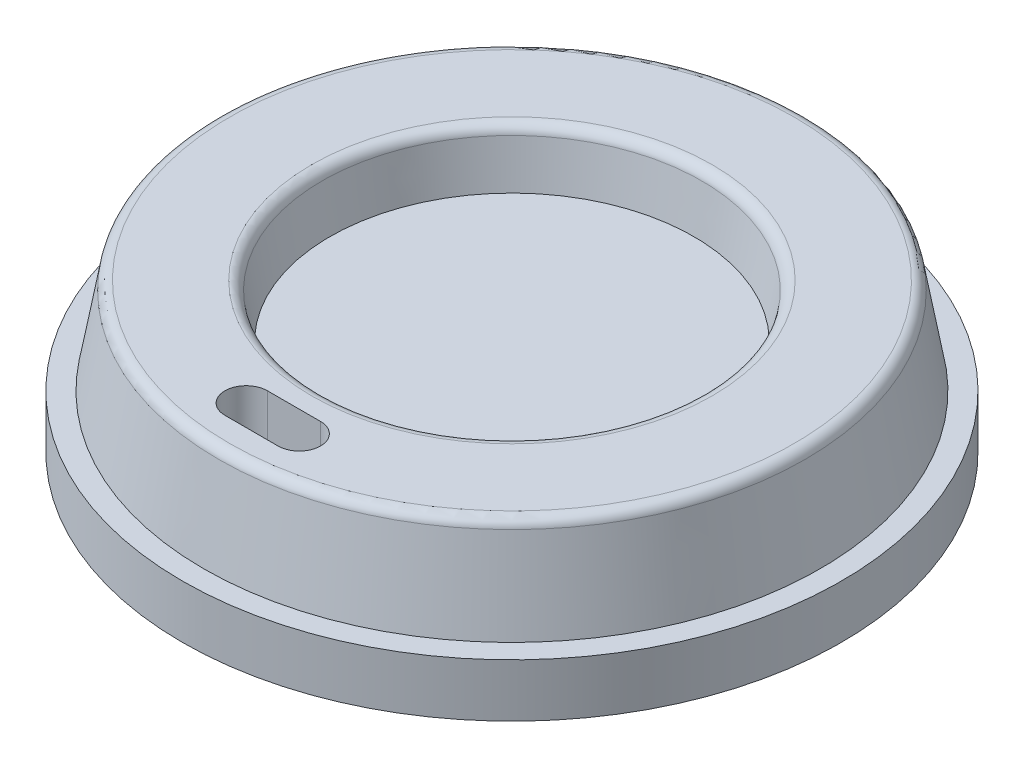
from build123d import *

# Parameters (mm, degrees)
SKETCH1_R           = 23
BOSS_EXTRUDE1_DEPTH = 5
SKETCH2_R           = 31
BOSS_EXTRUDE2_DEPTH = 5
SKETCH3_R           = 29
BOSS_EXTRUDE3_DEPTH = 9
BOSS_EXTRUDE3_TAPER = 10
FILLET1_R           = 1
SKETCH5_R           = 18
CUT_EXTRUDE1_DEPTH  = 5
CUT_EXTRUDE1_DRAFT  = -10
FILLET2_R           = 1
CUT_EXTRUDE2_DEPTH  = 48.780749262


with BuildPart() as part:
    # Sketch1 → Boss-Extrude1 (new body)
    with BuildSketch(Plane(origin=(0, 0, 0), x_dir=(1, 0, 0), z_dir=(0, 1, 0))):
        with Locations(Location((0, 0, 0), (0, 0, 270))):
            Circle(SKETCH1_R)
    extrude(amount=BOSS_EXTRUDE1_DEPTH)

    # Sketch2 → Boss-Extrude2 (add)
    with BuildSketch(Plane(origin=(0, 5, 0), x_dir=(1, 0, 0), z_dir=(0, 1, 0))):
        with Locations(Location((0, 0, 0), (0, 0, 270))):
            Circle(SKETCH2_R)
    extrude(amount=BOSS_EXTRUDE2_DEPTH)

    # Sketch3 → Boss-Extrude3 (add)
    with BuildSketch(Plane(origin=(0, 10, 0), x_dir=(1, 0, 0), z_dir=(0, 1, 0))):
        Circle(SKETCH3_R)
    extrude(amount=BOSS_EXTRUDE3_DEPTH, taper=BOSS_EXTRUDE3_TAPER)

    # Fillet1
    fillet1_edges = [part.edges().sort_by_distance(p)[0] for p in [
        (-27.413057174, 19, 0),
    ]]
    fillet(fillet1_edges, radius=FILLET1_R)


with BuildPart() as cut_extrude1_tool:
    # Sketch5 → Cut-Extrude1 (with draft: the straight prism first)
    with BuildSketch(Plane(origin=(0, 19, 0), x_dir=(1, 0, 0), z_dir=(0, 1, 0))):
        Circle(SKETCH5_R)
    extrude(amount=-CUT_EXTRUDE1_DEPTH)
    # Cut-Extrude1: the draft: its side faces are tilted about the plane it starts from
    cut_extrude1_sides = [cut_extrude1_tool.faces().sort_by_distance(p)[0] for p in [
        (-18, 16.5, 0),
    ]]
    draft(cut_extrude1_sides, Plane(origin=(0, 19, 0), x_dir=(1, 0, 0), z_dir=(0, 1, 0)), CUT_EXTRUDE1_DRAFT)


with BuildPart() as part_1:
    add(part.part)

    # Cut-Extrude1: cut by cut_extrude1_tool
    add(cut_extrude1_tool.part, mode=Mode.SUBTRACT)

    # Fillet2
    fillet2_edges = [part_1.edges().sort_by_distance(p)[0] for p in [
        (-18, 19, 0),
    ]]
    fillet(fillet2_edges, radius=FILLET2_R)

    # Sketch6 → Cut-Extrude2 (cut, through all)
    with BuildSketch(Plane(origin=(0, 19, 0), x_dir=(1, 0, 0), z_dir=(0, 1, 0))):
        with BuildLine():
            Line((-2.5, -20.5), (2.5, -20.5))
            ThreePointArc((2.5, -20.5), (4.5, -22.5), (2.5, -24.5))
            Line((2.5, -24.5), (-2.5, -24.5))
            ThreePointArc((-2.5, -24.5), (-4.5, -22.5), (-2.5, -20.5))
        make_face()
    extrude(amount=-CUT_EXTRUDE2_DEPTH, mode=Mode.SUBTRACT)


solid = part_1.part
